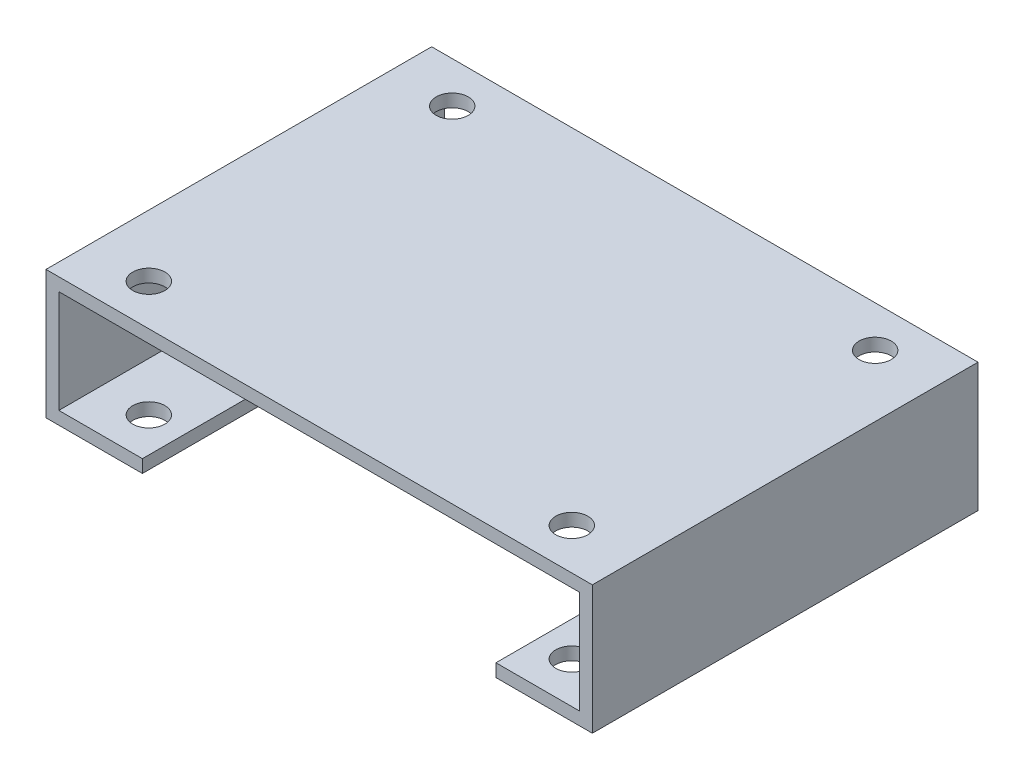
from build123d import *

# Parameters (mm, degrees)
EXTRUDE_THIN1_DEPTH = 76.2
SKETCH2_R           = 3.175
EXTRUDE1_DEPTH      = 97.772416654


with BuildPart() as part:
    # Sketch1 → Extrude-Thin1 (new body)
    with BuildSketch(Plane.XY):
        Polygon((-34.925, 0), (-53.975, 0), (-53.975, 25.4), (53.975, 25.4), (53.975, 0), (34.925, 0), (34.925, 2.54), (51.435, 2.54), (51.435, 22.86), (-51.435, 22.86), (-51.435, 2.54), (-34.925, 2.54), align=None)
    extrude(amount=EXTRUDE_THIN1_DEPTH)

    # Sketch2 → Extrude1 (cut, through all)
    with BuildSketch(Plane.XZ):
        with Locations((-41.783, 68.072)):
            Circle(SKETCH2_R)
        with Locations((-41.783, 8.128)):
            Circle(SKETCH2_R)
        with Locations((41.783, 68.072)):
            Circle(SKETCH2_R)
        with Locations((41.783, 8.128)):
            Circle(SKETCH2_R)
    extrude(amount=-EXTRUDE1_DEPTH, mode=Mode.SUBTRACT)


solid = part.part
